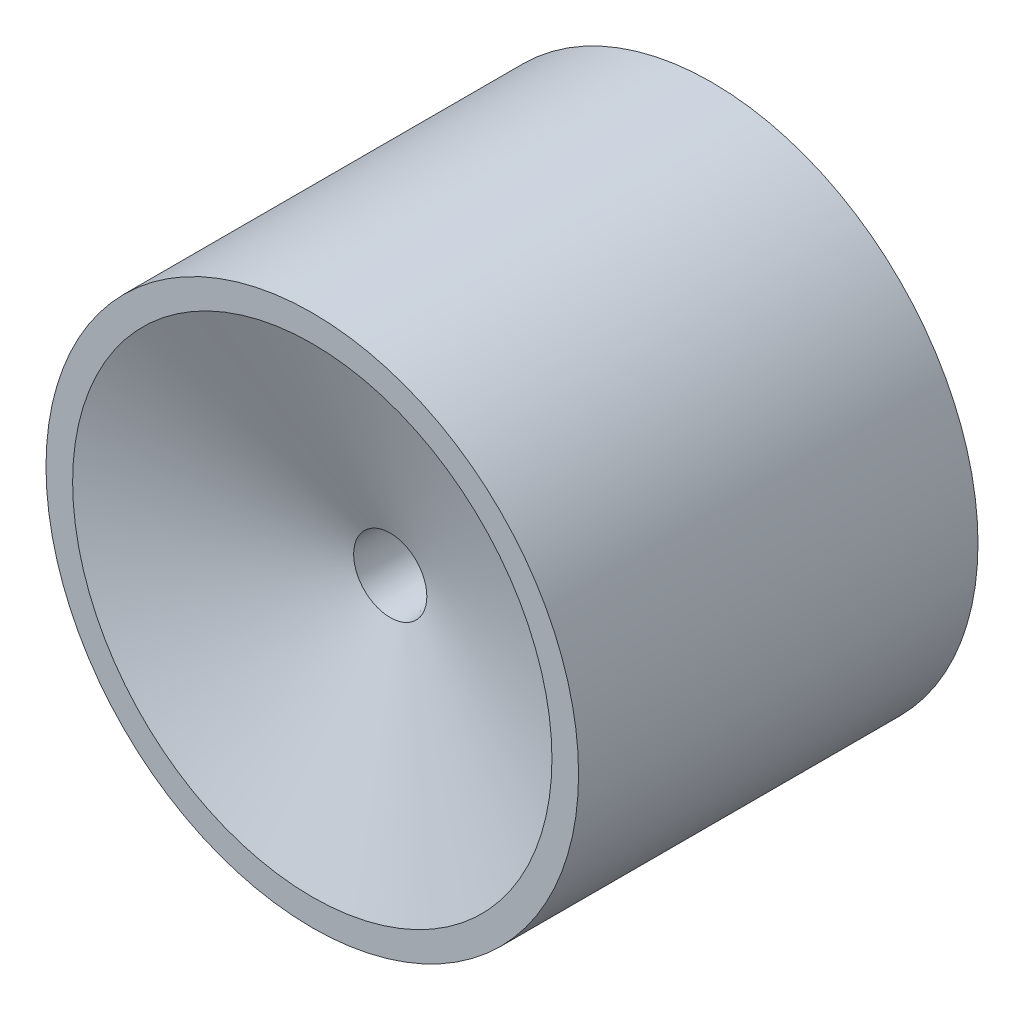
from build123d import *

# Parameters (mm, degrees)
ESQUISSE1_R             = 10
BOSS_EXTRU_1_DEPTH      = 15
ESQUISSE2_R             = 3.4
ENL_V_MAT_EXTRU_1_DEPTH = 8
ESQUISSE3_R             = 1.2
ENL_V_MAT_EXTRU_2_DEPTH = 17.248076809
ENL_V_MAT_EXTRU_2_DRAFT = 2.45
ESQUISSE5_R             = 9
ENL_V_MAT_EXTRU_3_DEPTH = 3
ENL_V_MAT_EXTRU_3_DRAFT = -69
ESQUISSE6_R             = 9
ESQUISSE6_R_2           = 5.5
ENL_V_MAT_EXTRU_4_DEPTH = 13


with BuildPart() as part:
    # Esquisse1 → Boss.-Extru.1 (new body)
    with BuildSketch(Plane.XY):
        Circle(ESQUISSE1_R)
    extrude(amount=BOSS_EXTRU_1_DEPTH)

    # Esquisse2 → Enl_v. mat.-Extru.1 (cut)
    with BuildSketch(Plane.XY):
        Circle(ESQUISSE2_R)
    extrude(amount=ENL_V_MAT_EXTRU_1_DEPTH, mode=Mode.SUBTRACT)


with BuildPart() as enl_v_mat_extru_2_tool:
    # Esquisse3 → Enl_v. mat.-Extru.2 (with draft: the straight prism first)
    with BuildSketch(Plane(origin=(0, 0, 8), x_dir=(-1, 0, 0), z_dir=(0, 0, -1))):
        Circle(ESQUISSE3_R)
    extrude(amount=-ENL_V_MAT_EXTRU_2_DEPTH)
    # Enl_v. mat.-Extru.2: the draft: its side faces are tilted about the plane it starts from
    enl_v_mat_extru_2_sides = [enl_v_mat_extru_2_tool.faces().sort_by_distance(p)[0] for p in [
        (1.2, 0, 16.624038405),
    ]]
    draft(enl_v_mat_extru_2_sides, Plane(origin=(0, 0, 8), x_dir=(-1, 0, 0), z_dir=(0, 0, -1)), ENL_V_MAT_EXTRU_2_DRAFT)


with BuildPart() as part_1:
    add(part.part)

    # Enl_v. mat.-Extru.2: cut by enl_v_mat_extru_2_tool
    add(enl_v_mat_extru_2_tool.part, mode=Mode.SUBTRACT)


with BuildPart() as enl_v_mat_extru_3_tool:
    # Esquisse5 → Enl_v. mat.-Extru.3 (with draft: the straight prism first)
    with BuildSketch(Plane.XY.offset(15)):
        Circle(ESQUISSE5_R)
    extrude(amount=-ENL_V_MAT_EXTRU_3_DEPTH)
    # Enl_v. mat.-Extru.3: the draft: its side faces are tilted about the plane it starts from
    enl_v_mat_extru_3_sides = [enl_v_mat_extru_3_tool.faces().sort_by_distance(p)[0] for p in [
        (-9, 0, 13.5),
    ]]
    draft(enl_v_mat_extru_3_sides, Plane.XY.offset(15), ENL_V_MAT_EXTRU_3_DRAFT)


with BuildPart() as part_2:
    add(part_1.part)

    # Enl_v. mat.-Extru.3: cut by enl_v_mat_extru_3_tool
    add(enl_v_mat_extru_3_tool.part, mode=Mode.SUBTRACT)

    # Esquisse6 → Enl_v. mat.-Extru.4 (cut)
    with BuildSketch(Plane(origin=(0, 0, 0), x_dir=(-1, 0, 0), z_dir=(0, 0, -1))):
        Circle(ESQUISSE6_R)
        Circle(ESQUISSE6_R_2, mode=Mode.SUBTRACT)
    extrude(amount=-ENL_V_MAT_EXTRU_4_DEPTH, mode=Mode.SUBTRACT)


solid = part_2.part
